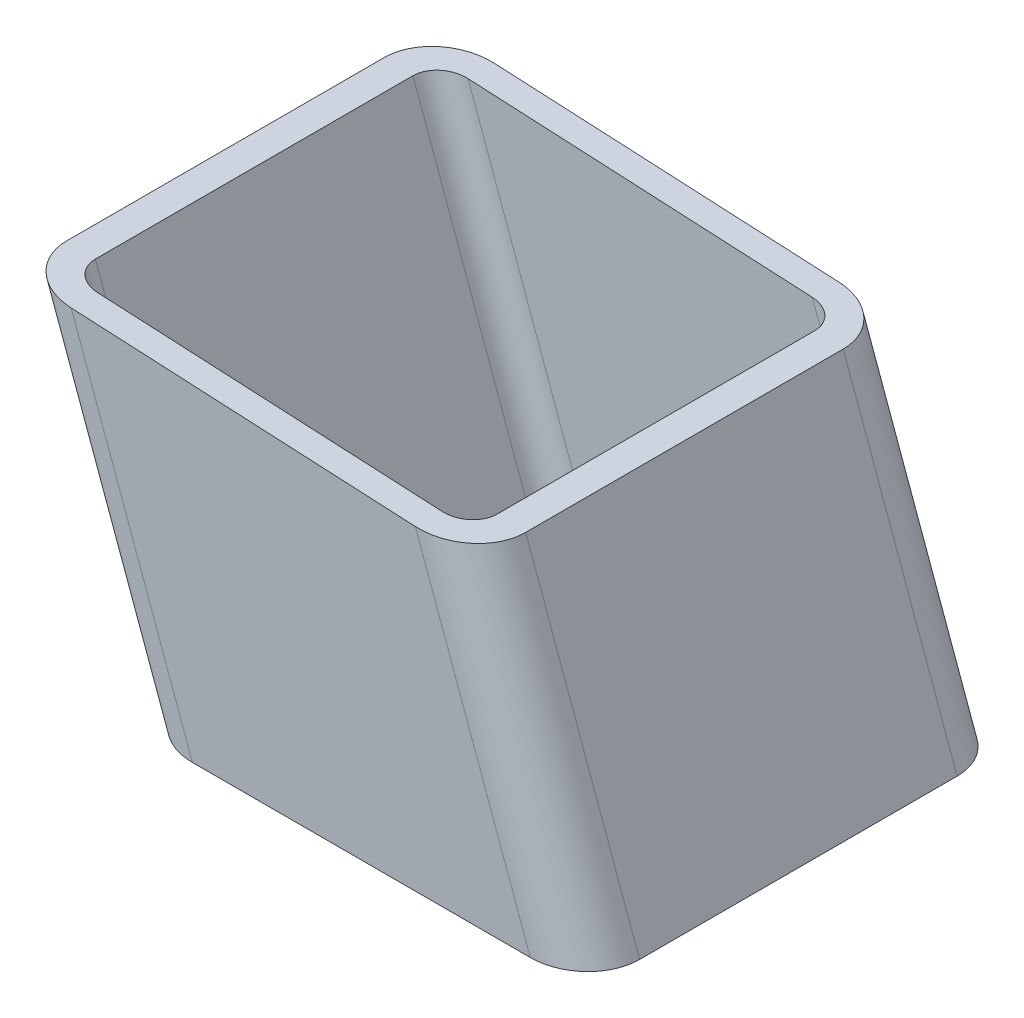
ISO-10303-21;
HEADER;
FILE_DESCRIPTION(('STEP AP214'),'2;1');
FILE_NAME('part.step','',(''),(''),'','','');
FILE_SCHEMA(('AUTOMOTIVE_DESIGN { 1 0 10303 214 1 1 1 1 }'));
ENDSEC;
DATA;
#1=APPLICATION_CONTEXT('core data for automotive mechanical design processes');
#2=APPLICATION_PROTOCOL_DEFINITION('international standard','automotive_design',2000,#1);
#3=PRODUCT_CONTEXT('',#1,'mechanical');
#4=PRODUCT('Part','Part','',(#3));
#5=PRODUCT_RELATED_PRODUCT_CATEGORY('part','',(#4));
#6=PRODUCT_DEFINITION_FORMATION('','',#4);
#7=PRODUCT_DEFINITION_CONTEXT('part definition',#1,'design');
#8=PRODUCT_DEFINITION('design','',#6,#7);
#9=PRODUCT_DEFINITION_SHAPE('','',#8);
#10=(LENGTH_UNIT() NAMED_UNIT(*) SI_UNIT(.MILLI.,.METRE.));
#11=(NAMED_UNIT(*) PLANE_ANGLE_UNIT() SI_UNIT($,.RADIAN.));
#12=(NAMED_UNIT(*) SI_UNIT($,.STERADIAN.) SOLID_ANGLE_UNIT());
#13=UNCERTAINTY_MEASURE_WITH_UNIT(LENGTH_MEASURE(1.E-05),#10,'distance_accuracy_value','');
#14=(GEOMETRIC_REPRESENTATION_CONTEXT(3) GLOBAL_UNCERTAINTY_ASSIGNED_CONTEXT((#13)) GLOBAL_UNIT_ASSIGNED_CONTEXT((#10,
#11,#12)) REPRESENTATION_CONTEXT('',''));
#15=CARTESIAN_POINT('',(0.,0.,0.));
#16=DIRECTION('',(0.,0.,1.));
#17=DIRECTION('',(1.,0.,0.));
#18=AXIS2_PLACEMENT_3D('',#15,#16,#17);
#19=CARTESIAN_POINT('',(5015.73310029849,13.6808057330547,30.));
#20=DIRECTION('',(-0.939692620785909,-0.342020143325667,0.));
#21=DIRECTION('',(0.342020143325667,-0.939692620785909,0.));
#22=AXIS2_PLACEMENT_3D('',#19,#20,#21);
#23=PLANE('',#22);
#24=DIRECTION('',(0.,0.,1.));
#25=VECTOR('',#24,1.);
#26=CARTESIAN_POINT('',(4999.96620301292,56.9999999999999,30.0000000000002));
#27=LINE('',#26,#25);
#28=CARTESIAN_POINT('',(4999.96620301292,57.0000000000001,-30.));
#29=VERTEX_POINT('',#28);
#30=CARTESIAN_POINT('',(4999.96620301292,56.9999999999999,30.));
#31=VERTEX_POINT('',#30);
#32=EDGE_CURVE('E53',#29,#31,#27,.T.);
#33=ORIENTED_EDGE('',*,*,#32,.F.);
#34=DIRECTION('',(-0.342020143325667,0.939692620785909,0.));
#35=VECTOR('',#34,1.);
#36=CARTESIAN_POINT('',(5015.73310029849,13.6808057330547,-30.));
#37=LINE('',#36,#35);
#38=CARTESIAN_POINT('',(4978.44648040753,116.124951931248,-30.));
#39=VERTEX_POINT('',#38);
#40=EDGE_CURVE('E38',#29,#39,#37,.T.);
#41=ORIENTED_EDGE('',*,*,#40,.T.);
#42=DIRECTION('',(0.,0.,-1.));
#43=VECTOR('',#42,1.);
#44=CARTESIAN_POINT('',(4978.44648040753,116.124951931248,30.));
#45=LINE('',#44,#43);
#46=CARTESIAN_POINT('',(4978.44648040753,116.124951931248,30.));
#47=VERTEX_POINT('',#46);
#48=EDGE_CURVE('E107',#47,#39,#45,.T.);
#49=ORIENTED_EDGE('',*,*,#48,.F.);
#50=DIRECTION('',(-0.342020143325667,0.939692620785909,0.));
#51=VECTOR('',#50,1.);
#52=CARTESIAN_POINT('',(5015.73310029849,13.6808057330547,30.));
#53=LINE('',#52,#51);
#54=EDGE_CURVE('E185',#31,#47,#53,.T.);
#55=ORIENTED_EDGE('',*,*,#54,.F.);
#56=EDGE_LOOP('',(#33,#41,#49,#55));
#57=FACE_BOUND('',#56,.T.);
#58=ADVANCED_FACE('F34',(#57),#23,.F.);
#59=CARTESIAN_POINT('',(5006.33617409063,10.2606042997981,-30.));
#60=DIRECTION('',(-0.342020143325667,0.939692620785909,0.));
#61=DIRECTION('',(-0.939692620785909,-0.342020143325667,0.));
#62=AXIS2_PLACEMENT_3D('',#59,#60,#61);
#63=CYLINDRICAL_SURFACE('',#62,10.);
#64=CARTESIAN_POINT('',(4989.32442528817,57.0000000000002,-30.));
#65=DIRECTION('',(0.,-1.,0.));
#66=DIRECTION('',(-1.,0.,0.));
#67=AXIS2_PLACEMENT_3D('',#64,#65,#66);
#68=ELLIPSE('',#67,10.6417777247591,10.);
#69=CARTESIAN_POINT('',(4989.32442528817,57.0000000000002,-40.));
#70=VERTEX_POINT('',#69);
#71=EDGE_CURVE('E155',#70,#29,#68,.T.);
#72=ORIENTED_EDGE('',*,*,#71,.F.);
#73=DIRECTION('',(-0.342020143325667,0.939692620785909,0.));
#74=VECTOR('',#73,1.);
#75=CARTESIAN_POINT('',(5006.33617409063,10.2606042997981,-40.));
#76=LINE('',#75,#74);
#77=CARTESIAN_POINT('',(4967.60717392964,116.667657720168,-40.));
#78=VERTEX_POINT('',#77);
#79=EDGE_CURVE('E165',#70,#78,#76,.T.);
#80=ORIENTED_EDGE('',*,*,#79,.T.);
#81=CARTESIAN_POINT('',(4967.60717392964,116.667657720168,-30.));
#82=DIRECTION('',(0.0500056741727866,0.998748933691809,0.));
#83=DIRECTION('',(-0.998748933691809,0.0500056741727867,0.));
#84=AXIS2_PLACEMENT_3D('',#81,#82,#83);
#85=ELLIPSE('',#84,10.8528841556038,10.);
#86=EDGE_CURVE('E102',#39,#78,#85,.T.);
#87=ORIENTED_EDGE('',*,*,#86,.F.);
#88=ORIENTED_EDGE('',*,*,#40,.F.);
#89=EDGE_LOOP('',(#72,#80,#87,#88));
#90=FACE_BOUND('',#89,.T.);
#91=ADVANCED_FACE('F164',(#90),#63,.T.);
#92=CARTESIAN_POINT('',(4949.95461684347,-10.260604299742,-40.));
#93=DIRECTION('',(0.,0.,1.));
#94=DIRECTION('',(1.,0.,0.));
#95=AXIS2_PLACEMENT_3D('',#92,#93,#94);
#96=PLANE('',#95);
#97=DIRECTION('',(1.,0.,0.));
#98=VECTOR('',#97,1.);
#99=CARTESIAN_POINT('',(4949.95461684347,57.0000000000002,-40.));
#100=LINE('',#99,#98);
#101=CARTESIAN_POINT('',(4925.47375893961,57.0000000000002,-40.));
#102=VERTEX_POINT('',#101);
#103=EDGE_CURVE('E152',#102,#70,#100,.T.);
#104=ORIENTED_EDGE('',*,*,#103,.F.);
#105=DIRECTION('',(-0.342020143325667,0.939692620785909,0.));
#106=VECTOR('',#105,1.);
#107=CARTESIAN_POINT('',(4949.95461684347,-10.260604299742,-40.));
#108=LINE('',#107,#106);
#109=CARTESIAN_POINT('',(4902.5713350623,119.923892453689,-40.));
#110=VERTEX_POINT('',#109);
#111=EDGE_CURVE('E170',#102,#110,#108,.T.);
#112=ORIENTED_EDGE('',*,*,#111,.T.);
#113=DIRECTION('',(-0.998748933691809,0.0500056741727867,0.));
#114=VECTOR('',#113,1.);
#115=CARTESIAN_POINT('',(4956.33795088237,117.231888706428,-40.));
#116=LINE('',#115,#114);
#117=EDGE_CURVE('E169',#78,#110,#116,.T.);
#118=ORIENTED_EDGE('',*,*,#117,.F.);
#119=ORIENTED_EDGE('',*,*,#79,.F.);
#120=EDGE_LOOP('',(#104,#112,#118,#119));
#121=FACE_BOUND('',#120,.T.);
#122=ADVANCED_FACE('F168',(#121),#96,.F.);
#123=CARTESIAN_POINT('',(4949.95461684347,-10.260604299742,-30.));
#124=DIRECTION('',(-0.342020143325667,0.939692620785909,0.));
#125=DIRECTION('',(-0.939692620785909,-0.342020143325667,0.));
#126=AXIS2_PLACEMENT_3D('',#123,#124,#125);
#127=CYLINDRICAL_SURFACE('',#126,10.);
#128=CARTESIAN_POINT('',(4925.47375893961,57.0000000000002,-30.));
#129=DIRECTION('',(0.,-1.,0.));
#130=DIRECTION('',(-1.,0.,0.));
#131=AXIS2_PLACEMENT_3D('',#128,#129,#130);
#132=ELLIPSE('',#131,10.6417777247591,10.);
#133=CARTESIAN_POINT('',(4914.83198121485,57.0000000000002,-30.));
#134=VERTEX_POINT('',#133);
#135=EDGE_CURVE('E150',#134,#102,#132,.T.);
#136=ORIENTED_EDGE('',*,*,#135,.F.);
#137=DIRECTION('',(-0.342020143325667,0.939692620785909,0.));
#138=VECTOR('',#137,1.);
#139=CARTESIAN_POINT('',(4940.55769063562,-13.6808057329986,-30.));
#140=LINE('',#139,#138);
#141=CARTESIAN_POINT('',(4891.73202858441,120.466598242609,-30.));
#142=VERTEX_POINT('',#141);
#143=EDGE_CURVE('E171',#134,#142,#140,.T.);
#144=ORIENTED_EDGE('',*,*,#143,.T.);
#145=CARTESIAN_POINT('',(4902.5713350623,119.923892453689,-30.));
#146=DIRECTION('',(0.0500056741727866,0.998748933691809,0.));
#147=DIRECTION('',(-0.998748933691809,0.0500056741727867,0.));
#148=AXIS2_PLACEMENT_3D('',#145,#146,#147);
#149=ELLIPSE('',#148,10.8528841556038,10.);
#150=EDGE_CURVE('E228',#110,#142,#149,.T.);
#151=ORIENTED_EDGE('',*,*,#150,.F.);
#152=ORIENTED_EDGE('',*,*,#111,.F.);
#153=EDGE_LOOP('',(#136,#144,#151,#152));
#154=FACE_BOUND('',#153,.T.);
#155=ADVANCED_FACE('F325',(#154),#127,.T.);
#156=CARTESIAN_POINT('',(4940.55769063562,-13.6808057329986,-30.));
#157=DIRECTION('',(0.939692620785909,0.342020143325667,0.));
#158=DIRECTION('',(-0.342020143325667,0.939692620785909,0.));
#159=AXIS2_PLACEMENT_3D('',#156,#157,#158);
#160=PLANE('',#159);
#161=DIRECTION('',(0.,0.,-1.));
#162=VECTOR('',#161,1.);
#163=CARTESIAN_POINT('',(4914.83198121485,57.0000000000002,-29.9999999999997));
#164=LINE('',#163,#162);
#165=CARTESIAN_POINT('',(4914.83198121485,56.9999999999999,30.));
#166=VERTEX_POINT('',#165);
#167=EDGE_CURVE('E253',#166,#134,#164,.T.);
#168=ORIENTED_EDGE('',*,*,#167,.F.);
#169=DIRECTION('',(-0.342020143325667,0.939692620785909,0.));
#170=VECTOR('',#169,1.);
#171=CARTESIAN_POINT('',(4940.55769063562,-13.6808057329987,30.));
#172=LINE('',#171,#170);
#173=CARTESIAN_POINT('',(4891.73202858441,120.466598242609,30.));
#174=VERTEX_POINT('',#173);
#175=EDGE_CURVE('E176',#166,#174,#172,.T.);
#176=ORIENTED_EDGE('',*,*,#175,.T.);
#177=DIRECTION('',(0.,0.,1.));
#178=VECTOR('',#177,1.);
#179=CARTESIAN_POINT('',(4891.73202858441,120.466598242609,-30.0000000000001));
#180=LINE('',#179,#178);
#181=EDGE_CURVE('E230',#142,#174,#180,.T.);
#182=ORIENTED_EDGE('',*,*,#181,.F.);
#183=ORIENTED_EDGE('',*,*,#143,.F.);
#184=EDGE_LOOP('',(#168,#176,#182,#183));
#185=FACE_BOUND('',#184,.T.);
#186=ADVANCED_FACE('F328',(#185),#160,.F.);
#187=CARTESIAN_POINT('',(4949.95461684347,-10.2606042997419,30.));
#188=DIRECTION('',(-0.342020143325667,0.939692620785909,0.));
#189=DIRECTION('',(-0.939692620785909,-0.342020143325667,0.));
#190=AXIS2_PLACEMENT_3D('',#187,#188,#189);
#191=CYLINDRICAL_SURFACE('',#190,10.);
#192=CARTESIAN_POINT('',(4925.47375893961,56.9999999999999,30.));
#193=DIRECTION('',(0.,-1.,0.));
#194=DIRECTION('',(-1.,0.,0.));
#195=AXIS2_PLACEMENT_3D('',#192,#193,#194);
#196=ELLIPSE('',#195,10.6417777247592,10.);
#197=CARTESIAN_POINT('',(4925.47375893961,56.9999999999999,40.));
#198=VERTEX_POINT('',#197);
#199=EDGE_CURVE('E255',#198,#166,#196,.T.);
#200=ORIENTED_EDGE('',*,*,#199,.F.);
#201=DIRECTION('',(-0.342020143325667,0.939692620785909,0.));
#202=VECTOR('',#201,1.);
#203=CARTESIAN_POINT('',(4949.95461684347,-10.260604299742,40.));
#204=LINE('',#203,#202);
#205=CARTESIAN_POINT('',(4902.5713350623,119.923892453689,40.));
#206=VERTEX_POINT('',#205);
#207=EDGE_CURVE('E179',#198,#206,#204,.T.);
#208=ORIENTED_EDGE('',*,*,#207,.T.);
#209=CARTESIAN_POINT('',(4902.5713350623,119.923892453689,30.));
#210=DIRECTION('',(0.0500056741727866,0.998748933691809,0.));
#211=DIRECTION('',(-0.998748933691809,0.0500056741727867,0.));
#212=AXIS2_PLACEMENT_3D('',#209,#210,#211);
#213=ELLIPSE('',#212,10.8528841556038,10.);
#214=EDGE_CURVE('E232',#174,#206,#213,.T.);
#215=ORIENTED_EDGE('',*,*,#214,.F.);
#216=ORIENTED_EDGE('',*,*,#175,.F.);
#217=EDGE_LOOP('',(#200,#208,#215,#216));
#218=FACE_BOUND('',#217,.T.);
#219=ADVANCED_FACE('F332',(#218),#191,.T.);
#220=CARTESIAN_POINT('',(5006.33617409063,10.2606042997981,40.));
#221=DIRECTION('',(0.,0.,-1.));
#222=DIRECTION('',(-1.,0.,0.));
#223=AXIS2_PLACEMENT_3D('',#220,#221,#222);
#224=PLANE('',#223);
#225=DIRECTION('',(-1.,0.,0.));
#226=VECTOR('',#225,1.);
#227=CARTESIAN_POINT('',(5006.33617409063,56.9999999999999,40.));
#228=LINE('',#227,#226);
#229=CARTESIAN_POINT('',(4989.32442528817,56.9999999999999,40.));
#230=VERTEX_POINT('',#229);
#231=EDGE_CURVE('E257',#230,#198,#228,.T.);
#232=ORIENTED_EDGE('',*,*,#231,.F.);
#233=DIRECTION('',(-0.342020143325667,0.939692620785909,0.));
#234=VECTOR('',#233,1.);
#235=CARTESIAN_POINT('',(5006.33617409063,10.2606042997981,40.));
#236=LINE('',#235,#234);
#237=CARTESIAN_POINT('',(4967.60717392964,116.667657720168,40.));
#238=VERTEX_POINT('',#237);
#239=EDGE_CURVE('E182',#230,#238,#236,.T.);
#240=ORIENTED_EDGE('',*,*,#239,.T.);
#241=DIRECTION('',(0.998748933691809,-0.0500056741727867,0.));
#242=VECTOR('',#241,1.);
#243=CARTESIAN_POINT('',(5011.55362918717,114.467332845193,40.));
#244=LINE('',#243,#242);
#245=EDGE_CURVE('E234',#206,#238,#244,.T.);
#246=ORIENTED_EDGE('',*,*,#245,.F.);
#247=ORIENTED_EDGE('',*,*,#207,.F.);
#248=EDGE_LOOP('',(#232,#240,#246,#247));
#249=FACE_BOUND('',#248,.T.);
#250=ADVANCED_FACE('F335',(#249),#224,.F.);
#251=CARTESIAN_POINT('',(5006.33617409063,10.2606042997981,30.));
#252=DIRECTION('',(-0.342020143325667,0.939692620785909,0.));
#253=DIRECTION('',(-0.939692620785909,-0.342020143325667,0.));
#254=AXIS2_PLACEMENT_3D('',#251,#252,#253);
#255=CYLINDRICAL_SURFACE('',#254,10.);
#256=CARTESIAN_POINT('',(4989.32442528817,56.9999999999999,30.));
#257=DIRECTION('',(0.,-1.,0.));
#258=DIRECTION('',(-1.,0.,0.));
#259=AXIS2_PLACEMENT_3D('',#256,#257,#258);
#260=ELLIPSE('',#259,10.6417777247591,10.);
#261=EDGE_CURVE('E236',#31,#230,#260,.T.);
#262=ORIENTED_EDGE('',*,*,#261,.F.);
#263=ORIENTED_EDGE('',*,*,#54,.T.);
#264=CARTESIAN_POINT('',(4967.60717392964,116.667657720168,30.));
#265=DIRECTION('',(0.0500056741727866,0.998748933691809,0.));
#266=DIRECTION('',(-0.998748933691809,0.0500056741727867,0.));
#267=AXIS2_PLACEMENT_3D('',#264,#265,#266);
#268=ELLIPSE('',#267,10.8528841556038,10.);
#269=EDGE_CURVE('E110',#238,#47,#268,.T.);
#270=ORIENTED_EDGE('',*,*,#269,.F.);
#271=ORIENTED_EDGE('',*,*,#239,.F.);
#272=EDGE_LOOP('',(#262,#263,#270,#271));
#273=FACE_BOUND('',#272,.T.);
#274=ADVANCED_FACE('F36',(#273),#255,.T.);
#275=CARTESIAN_POINT('',(6158.08276398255,57.0625533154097,-40.));
#276=DIRECTION('',(0.0500056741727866,0.998748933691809,0.));
#277=DIRECTION('',(-0.998748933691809,0.0500056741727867,0.));
#278=AXIS2_PLACEMENT_3D('',#275,#276,#277);
#279=PLANE('',#278);
#280=DIRECTION('',(0.,0.,1.));
#281=VECTOR('',#280,1.);
#282=CARTESIAN_POINT('',(4897.15168182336,120.195245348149,-30.));
#283=LINE('',#282,#281);
#284=CARTESIAN_POINT('',(4897.15168182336,120.195245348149,-30.));
#285=VERTEX_POINT('',#284);
#286=CARTESIAN_POINT('',(4897.15168182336,120.195245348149,30.));
#287=VERTEX_POINT('',#286);
#288=EDGE_CURVE('E191',#285,#287,#283,.T.);
#289=ORIENTED_EDGE('',*,*,#288,.F.);
#290=CARTESIAN_POINT('',(4902.5713350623,119.923892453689,-30.));
#291=DIRECTION('',(0.0500056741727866,0.998748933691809,0.));
#292=DIRECTION('',(-0.998748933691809,0.0500056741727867,0.));
#293=AXIS2_PLACEMENT_3D('',#290,#291,#292);
#294=ELLIPSE('',#293,5.4264420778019,5.00000000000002);
#295=CARTESIAN_POINT('',(4902.5713350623,119.923892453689,-35.));
#296=VERTEX_POINT('',#295);
#297=EDGE_CURVE('E196',#296,#285,#294,.T.);
#298=ORIENTED_EDGE('',*,*,#297,.F.);
#299=DIRECTION('',(-0.998748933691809,0.0500056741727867,0.));
#300=VECTOR('',#299,1.);
#301=CARTESIAN_POINT('',(4956.33795088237,117.231888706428,-35.));
#302=LINE('',#301,#300);
#303=CARTESIAN_POINT('',(4967.60717392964,116.667657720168,-35.));
#304=VERTEX_POINT('',#303);
#305=EDGE_CURVE('E201',#304,#296,#302,.T.);
#306=ORIENTED_EDGE('',*,*,#305,.F.);
#307=CARTESIAN_POINT('',(4967.60717392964,116.667657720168,-30.));
#308=DIRECTION('',(0.0500056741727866,0.998748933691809,0.));
#309=DIRECTION('',(-0.998748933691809,0.0500056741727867,0.));
#310=AXIS2_PLACEMENT_3D('',#307,#308,#309);
#311=ELLIPSE('',#310,5.42644207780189,5.00000000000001);
#312=CARTESIAN_POINT('',(4973.02682716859,116.396304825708,-30.));
#313=VERTEX_POINT('',#312);
#314=EDGE_CURVE('E206',#313,#304,#311,.T.);
#315=ORIENTED_EDGE('',*,*,#314,.F.);
#316=DIRECTION('',(0.,0.,-1.));
#317=VECTOR('',#316,1.);
#318=CARTESIAN_POINT('',(4973.02682716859,116.396304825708,30.));
#319=LINE('',#318,#317);
#320=CARTESIAN_POINT('',(4973.02682716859,116.396304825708,30.));
#321=VERTEX_POINT('',#320);
#322=EDGE_CURVE('E211',#321,#313,#319,.T.);
#323=ORIENTED_EDGE('',*,*,#322,.F.);
#324=CARTESIAN_POINT('',(4967.60717392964,116.667657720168,30.));
#325=DIRECTION('',(0.0500056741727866,0.998748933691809,0.));
#326=DIRECTION('',(-0.998748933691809,0.0500056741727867,0.));
#327=AXIS2_PLACEMENT_3D('',#324,#325,#326);
#328=ELLIPSE('',#327,5.42644207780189,5.00000000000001);
#329=CARTESIAN_POINT('',(4967.60717392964,116.667657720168,35.));
#330=VERTEX_POINT('',#329);
#331=EDGE_CURVE('E216',#330,#321,#328,.T.);
#332=ORIENTED_EDGE('',*,*,#331,.F.);
#333=DIRECTION('',(0.998748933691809,-0.0500056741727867,0.));
#334=VECTOR('',#333,1.);
#335=CARTESIAN_POINT('',(5011.55362918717,114.467332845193,35.));
#336=LINE('',#335,#334);
#337=CARTESIAN_POINT('',(4902.5713350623,119.923892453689,35.));
#338=VERTEX_POINT('',#337);
#339=EDGE_CURVE('E221',#338,#330,#336,.T.);
#340=ORIENTED_EDGE('',*,*,#339,.F.);
#341=CARTESIAN_POINT('',(4902.5713350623,119.923892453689,30.));
#342=DIRECTION('',(0.0500056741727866,0.998748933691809,0.));
#343=DIRECTION('',(-0.998748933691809,0.0500056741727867,0.));
#344=AXIS2_PLACEMENT_3D('',#341,#342,#343);
#345=ELLIPSE('',#344,5.42644207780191,5.00000000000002);
#346=EDGE_CURVE('E11',#287,#338,#345,.T.);
#347=ORIENTED_EDGE('',*,*,#346,.F.);
#348=EDGE_LOOP('',(#289,#298,#306,#315,#323,#332,#340,#347));
#349=FACE_BOUND('',#348,.T.);
#350=ORIENTED_EDGE('',*,*,#269,.T.);
#351=ORIENTED_EDGE('',*,*,#48,.T.);
#352=ORIENTED_EDGE('',*,*,#86,.T.);
#353=ORIENTED_EDGE('',*,*,#117,.T.);
#354=ORIENTED_EDGE('',*,*,#150,.T.);
#355=ORIENTED_EDGE('',*,*,#181,.T.);
#356=ORIENTED_EDGE('',*,*,#214,.T.);
#357=ORIENTED_EDGE('',*,*,#245,.T.);
#358=EDGE_LOOP('',(#350,#351,#352,#353,#354,#355,#356,#357));
#359=FACE_BOUND('',#358,.T.);
#360=ADVANCED_FACE('F286',(#349,#359),#279,.T.);
#361=CARTESIAN_POINT('',(9149.96897120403,57.0000000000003,-59.9999999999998));
#362=DIRECTION('',(0.,-1.,0.));
#363=DIRECTION('',(0.,0.,-1.));
#364=AXIS2_PLACEMENT_3D('',#361,#362,#363);
#365=PLANE('',#364);
#366=DIRECTION('',(-1.,0.,0.));
#367=VECTOR('',#366,1.);
#368=CARTESIAN_POINT('',(5006.33617409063,56.9999999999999,35.));
#369=LINE('',#368,#367);
#370=CARTESIAN_POINT('',(4989.32442528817,56.9999999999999,35.));
#371=VERTEX_POINT('',#370);
#372=CARTESIAN_POINT('',(4925.47375893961,56.9999999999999,35.));
#373=VERTEX_POINT('',#372);
#374=EDGE_CURVE('E222',#371,#373,#369,.T.);
#375=ORIENTED_EDGE('',*,*,#374,.F.);
#376=CARTESIAN_POINT('',(4989.32442528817,56.9999999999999,30.));
#377=DIRECTION('',(0.,-1.,0.));
#378=DIRECTION('',(-1.,0.,0.));
#379=AXIS2_PLACEMENT_3D('',#376,#377,#378);
#380=ELLIPSE('',#379,5.32088886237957,5.00000000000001);
#381=CARTESIAN_POINT('',(4994.64531415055,56.9999999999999,30.));
#382=VERTEX_POINT('',#381);
#383=EDGE_CURVE('E217',#382,#371,#380,.T.);
#384=ORIENTED_EDGE('',*,*,#383,.F.);
#385=DIRECTION('',(0.,0.,1.));
#386=VECTOR('',#385,1.);
#387=CARTESIAN_POINT('',(4994.64531415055,56.9999999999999,30.0000000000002));
#388=LINE('',#387,#386);
#389=CARTESIAN_POINT('',(4994.64531415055,57.0000000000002,-30.));
#390=VERTEX_POINT('',#389);
#391=EDGE_CURVE('E212',#390,#382,#388,.T.);
#392=ORIENTED_EDGE('',*,*,#391,.F.);
#393=CARTESIAN_POINT('',(4989.32442528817,57.0000000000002,-30.));
#394=DIRECTION('',(0.,-1.,0.));
#395=DIRECTION('',(-1.,0.,0.));
#396=AXIS2_PLACEMENT_3D('',#393,#394,#395);
#397=ELLIPSE('',#396,5.32088886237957,5.00000000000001);
#398=CARTESIAN_POINT('',(4989.32442528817,57.0000000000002,-35.));
#399=VERTEX_POINT('',#398);
#400=EDGE_CURVE('E207',#399,#390,#397,.T.);
#401=ORIENTED_EDGE('',*,*,#400,.F.);
#402=DIRECTION('',(1.,0.,0.));
#403=VECTOR('',#402,1.);
#404=CARTESIAN_POINT('',(4949.95461684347,57.0000000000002,-35.));
#405=LINE('',#404,#403);
#406=CARTESIAN_POINT('',(4925.47375893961,57.0000000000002,-35.));
#407=VERTEX_POINT('',#406);
#408=EDGE_CURVE('E202',#407,#399,#405,.T.);
#409=ORIENTED_EDGE('',*,*,#408,.F.);
#410=CARTESIAN_POINT('',(4925.47375893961,57.0000000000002,-30.));
#411=DIRECTION('',(0.,-1.,0.));
#412=DIRECTION('',(-1.,0.,0.));
#413=AXIS2_PLACEMENT_3D('',#410,#411,#412);
#414=ELLIPSE('',#413,5.32088886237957,5.00000000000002);
#415=CARTESIAN_POINT('',(4920.15287007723,57.0000000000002,-30.));
#416=VERTEX_POINT('',#415);
#417=EDGE_CURVE('E197',#416,#407,#414,.T.);
#418=ORIENTED_EDGE('',*,*,#417,.F.);
#419=DIRECTION('',(0.,0.,-1.));
#420=VECTOR('',#419,1.);
#421=CARTESIAN_POINT('',(4920.15287007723,57.0000000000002,-29.9999999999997));
#422=LINE('',#421,#420);
#423=CARTESIAN_POINT('',(4920.15287007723,56.9999999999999,30.));
#424=VERTEX_POINT('',#423);
#425=EDGE_CURVE('E192',#424,#416,#422,.T.);
#426=ORIENTED_EDGE('',*,*,#425,.F.);
#427=CARTESIAN_POINT('',(4925.47375893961,56.9999999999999,30.));
#428=DIRECTION('',(0.,-1.,0.));
#429=DIRECTION('',(-1.,0.,0.));
#430=AXIS2_PLACEMENT_3D('',#427,#428,#429);
#431=ELLIPSE('',#430,5.32088886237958,5.00000000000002);
#432=EDGE_CURVE('E225',#373,#424,#431,.T.);
#433=ORIENTED_EDGE('',*,*,#432,.F.);
#434=EDGE_LOOP('',(#375,#384,#392,#401,#409,#418,#426,#433));
#435=FACE_BOUND('',#434,.T.);
#436=ORIENTED_EDGE('',*,*,#261,.T.);
#437=ORIENTED_EDGE('',*,*,#231,.T.);
#438=ORIENTED_EDGE('',*,*,#199,.T.);
#439=ORIENTED_EDGE('',*,*,#167,.T.);
#440=ORIENTED_EDGE('',*,*,#135,.T.);
#441=ORIENTED_EDGE('',*,*,#103,.T.);
#442=ORIENTED_EDGE('',*,*,#71,.T.);
#443=ORIENTED_EDGE('',*,*,#32,.T.);
#444=EDGE_LOOP('',(#436,#437,#438,#439,#440,#441,#442,#443));
#445=FACE_BOUND('',#444,.T.);
#446=ADVANCED_FACE('F154',(#435,#445),#365,.T.);
#447=CARTESIAN_POINT('',(4945.25615373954,-11.9707050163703,-30.));
#448=DIRECTION('',(0.939692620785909,0.342020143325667,0.));
#449=DIRECTION('',(-0.342020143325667,0.939692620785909,0.));
#450=AXIS2_PLACEMENT_3D('',#447,#448,#449);
#451=PLANE('',#450);
#452=DIRECTION('',(-0.342020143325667,0.939692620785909,0.));
#453=VECTOR('',#452,1.);
#454=CARTESIAN_POINT('',(4945.25615373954,-11.9707050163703,30.));
#455=LINE('',#454,#453);
#456=EDGE_CURVE('E44',#424,#287,#455,.T.);
#457=ORIENTED_EDGE('',*,*,#456,.F.);
#458=ORIENTED_EDGE('',*,*,#425,.T.);
#459=DIRECTION('',(-0.342020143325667,0.939692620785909,0.));
#460=VECTOR('',#459,1.);
#461=CARTESIAN_POINT('',(4945.25615373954,-11.9707050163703,-30.));
#462=LINE('',#461,#460);
#463=EDGE_CURVE('E188',#416,#285,#462,.T.);
#464=ORIENTED_EDGE('',*,*,#463,.T.);
#465=ORIENTED_EDGE('',*,*,#288,.T.);
#466=EDGE_LOOP('',(#457,#458,#464,#465));
#467=FACE_BOUND('',#466,.T.);
#468=ADVANCED_FACE('F283',(#467),#451,.T.);
#469=CARTESIAN_POINT('',(4949.95461684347,-10.260604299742,-30.));
#470=DIRECTION('',(-0.342020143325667,0.939692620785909,0.));
#471=DIRECTION('',(-0.939692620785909,-0.342020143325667,0.));
#472=AXIS2_PLACEMENT_3D('',#469,#470,#471);
#473=CYLINDRICAL_SURFACE('',#472,5.00000000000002);
#474=ORIENTED_EDGE('',*,*,#463,.F.);
#475=ORIENTED_EDGE('',*,*,#417,.T.);
#476=DIRECTION('',(-0.342020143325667,0.939692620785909,0.));
#477=VECTOR('',#476,1.);
#478=CARTESIAN_POINT('',(4949.95461684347,-10.260604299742,-35.));
#479=LINE('',#478,#477);
#480=EDGE_CURVE('E193',#407,#296,#479,.T.);
#481=ORIENTED_EDGE('',*,*,#480,.T.);
#482=ORIENTED_EDGE('',*,*,#297,.T.);
#483=EDGE_LOOP('',(#474,#475,#481,#482));
#484=FACE_BOUND('',#483,.T.);
#485=ADVANCED_FACE('F288',(#484),#473,.F.);
#486=CARTESIAN_POINT('',(4949.95461684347,-10.260604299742,-35.));
#487=DIRECTION('',(0.,0.,1.));
#488=DIRECTION('',(1.,0.,0.));
#489=AXIS2_PLACEMENT_3D('',#486,#487,#488);
#490=PLANE('',#489);
#491=ORIENTED_EDGE('',*,*,#480,.F.);
#492=ORIENTED_EDGE('',*,*,#408,.T.);
#493=DIRECTION('',(-0.342020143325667,0.939692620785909,0.));
#494=VECTOR('',#493,1.);
#495=CARTESIAN_POINT('',(5006.33617409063,10.260604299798,-35.));
#496=LINE('',#495,#494);
#497=EDGE_CURVE('E198',#399,#304,#496,.T.);
#498=ORIENTED_EDGE('',*,*,#497,.T.);
#499=ORIENTED_EDGE('',*,*,#305,.T.);
#500=EDGE_LOOP('',(#491,#492,#498,#499));
#501=FACE_BOUND('',#500,.T.);
#502=ADVANCED_FACE('F292',(#501),#490,.T.);
#503=CARTESIAN_POINT('',(5006.33617409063,10.2606042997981,-30.));
#504=DIRECTION('',(-0.342020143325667,0.939692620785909,0.));
#505=DIRECTION('',(-0.939692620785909,-0.342020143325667,0.));
#506=AXIS2_PLACEMENT_3D('',#503,#504,#505);
#507=CYLINDRICAL_SURFACE('',#506,5.00000000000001);
#508=ORIENTED_EDGE('',*,*,#497,.F.);
#509=ORIENTED_EDGE('',*,*,#400,.T.);
#510=DIRECTION('',(-0.342020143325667,0.939692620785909,0.));
#511=VECTOR('',#510,1.);
#512=CARTESIAN_POINT('',(5011.03463719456,11.9707050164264,-30.));
#513=LINE('',#512,#511);
#514=EDGE_CURVE('E203',#390,#313,#513,.T.);
#515=ORIENTED_EDGE('',*,*,#514,.T.);
#516=ORIENTED_EDGE('',*,*,#314,.T.);
#517=EDGE_LOOP('',(#508,#509,#515,#516));
#518=FACE_BOUND('',#517,.T.);
#519=ADVANCED_FACE('F295',(#518),#507,.F.);
#520=CARTESIAN_POINT('',(5011.03463719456,11.9707050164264,30.));
#521=DIRECTION('',(-0.939692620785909,-0.342020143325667,0.));
#522=DIRECTION('',(0.342020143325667,-0.939692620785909,0.));
#523=AXIS2_PLACEMENT_3D('',#520,#521,#522);
#524=PLANE('',#523);
#525=ORIENTED_EDGE('',*,*,#514,.F.);
#526=ORIENTED_EDGE('',*,*,#391,.T.);
#527=DIRECTION('',(-0.342020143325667,0.939692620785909,0.));
#528=VECTOR('',#527,1.);
#529=CARTESIAN_POINT('',(5011.03463719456,11.9707050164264,30.));
#530=LINE('',#529,#528);
#531=EDGE_CURVE('E208',#382,#321,#530,.T.);
#532=ORIENTED_EDGE('',*,*,#531,.T.);
#533=ORIENTED_EDGE('',*,*,#322,.T.);
#534=EDGE_LOOP('',(#525,#526,#532,#533));
#535=FACE_BOUND('',#534,.T.);
#536=ADVANCED_FACE('F298',(#535),#524,.T.);
#537=CARTESIAN_POINT('',(5006.33617409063,10.2606042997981,30.));
#538=DIRECTION('',(-0.342020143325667,0.939692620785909,0.));
#539=DIRECTION('',(-0.939692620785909,-0.342020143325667,0.));
#540=AXIS2_PLACEMENT_3D('',#537,#538,#539);
#541=CYLINDRICAL_SURFACE('',#540,5.00000000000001);
#542=ORIENTED_EDGE('',*,*,#531,.F.);
#543=ORIENTED_EDGE('',*,*,#383,.T.);
#544=DIRECTION('',(-0.342020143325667,0.939692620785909,0.));
#545=VECTOR('',#544,1.);
#546=CARTESIAN_POINT('',(5006.33617409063,10.260604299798,35.));
#547=LINE('',#546,#545);
#548=EDGE_CURVE('E213',#371,#330,#547,.T.);
#549=ORIENTED_EDGE('',*,*,#548,.T.);
#550=ORIENTED_EDGE('',*,*,#331,.T.);
#551=EDGE_LOOP('',(#542,#543,#549,#550));
#552=FACE_BOUND('',#551,.T.);
#553=ADVANCED_FACE('F301',(#552),#541,.F.);
#554=CARTESIAN_POINT('',(5006.33617409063,10.260604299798,35.));
#555=DIRECTION('',(0.,0.,-1.));
#556=DIRECTION('',(-1.,0.,0.));
#557=AXIS2_PLACEMENT_3D('',#554,#555,#556);
#558=PLANE('',#557);
#559=ORIENTED_EDGE('',*,*,#548,.F.);
#560=ORIENTED_EDGE('',*,*,#374,.T.);
#561=DIRECTION('',(-0.342020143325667,0.939692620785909,0.));
#562=VECTOR('',#561,1.);
#563=CARTESIAN_POINT('',(4949.95461684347,-10.260604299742,35.));
#564=LINE('',#563,#562);
#565=EDGE_CURVE('E218',#373,#338,#564,.T.);
#566=ORIENTED_EDGE('',*,*,#565,.T.);
#567=ORIENTED_EDGE('',*,*,#339,.T.);
#568=EDGE_LOOP('',(#559,#560,#566,#567));
#569=FACE_BOUND('',#568,.T.);
#570=ADVANCED_FACE('F304',(#569),#558,.T.);
#571=CARTESIAN_POINT('',(4949.95461684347,-10.2606042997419,30.));
#572=DIRECTION('',(-0.342020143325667,0.939692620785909,0.));
#573=DIRECTION('',(-0.939692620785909,-0.342020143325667,0.));
#574=AXIS2_PLACEMENT_3D('',#571,#572,#573);
#575=CYLINDRICAL_SURFACE('',#574,5.00000000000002);
#576=ORIENTED_EDGE('',*,*,#565,.F.);
#577=ORIENTED_EDGE('',*,*,#432,.T.);
#578=ORIENTED_EDGE('',*,*,#456,.T.);
#579=ORIENTED_EDGE('',*,*,#346,.T.);
#580=EDGE_LOOP('',(#576,#577,#578,#579));
#581=FACE_BOUND('',#580,.T.);
#582=ADVANCED_FACE('F280',(#581),#575,.F.);
#583=CLOSED_SHELL('',(#58,#91,#122,#155,#186,#219,#250,#274,#360,#446,#468,#485,#502,#519,#536,
#553,#570,#582));
#584=MANIFOLD_SOLID_BREP('B2',#583);
#585=ADVANCED_BREP_SHAPE_REPRESENTATION('',(#18,#584),#14);
#586=SHAPE_DEFINITION_REPRESENTATION(#9,#585);
ENDSEC;
END-ISO-10303-21;
